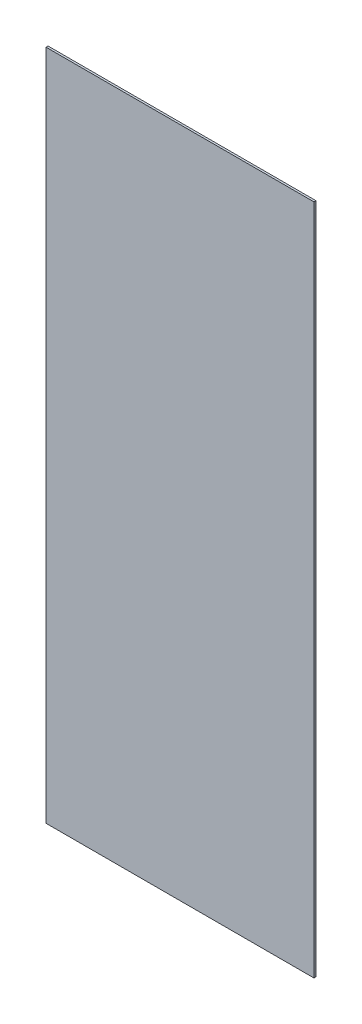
ISO-10303-21;
HEADER;
FILE_DESCRIPTION(('STEP AP214'),'2;1');
FILE_NAME('part.step','',(''),(''),'','','');
FILE_SCHEMA(('AUTOMOTIVE_DESIGN { 1 0 10303 214 1 1 1 1 }'));
ENDSEC;
DATA;
#1=APPLICATION_CONTEXT('core data for automotive mechanical design processes');
#2=APPLICATION_PROTOCOL_DEFINITION('international standard','automotive_design',2000,#1);
#3=PRODUCT_CONTEXT('',#1,'mechanical');
#4=PRODUCT('Part','Part','',(#3));
#5=PRODUCT_RELATED_PRODUCT_CATEGORY('part','',(#4));
#6=PRODUCT_DEFINITION_FORMATION('','',#4);
#7=PRODUCT_DEFINITION_CONTEXT('part definition',#1,'design');
#8=PRODUCT_DEFINITION('design','',#6,#7);
#9=PRODUCT_DEFINITION_SHAPE('','',#8);
#10=(LENGTH_UNIT() NAMED_UNIT(*) SI_UNIT(.MILLI.,.METRE.));
#11=(NAMED_UNIT(*) PLANE_ANGLE_UNIT() SI_UNIT($,.RADIAN.));
#12=(NAMED_UNIT(*) SI_UNIT($,.STERADIAN.) SOLID_ANGLE_UNIT());
#13=UNCERTAINTY_MEASURE_WITH_UNIT(LENGTH_MEASURE(1.E-05),#10,'distance_accuracy_value','');
#14=(GEOMETRIC_REPRESENTATION_CONTEXT(3) GLOBAL_UNCERTAINTY_ASSIGNED_CONTEXT((#13)) GLOBAL_UNIT_ASSIGNED_CONTEXT((#10,
#11,#12)) REPRESENTATION_CONTEXT('',''));
#15=CARTESIAN_POINT('',(0.,0.,0.));
#16=DIRECTION('',(0.,0.,1.));
#17=DIRECTION('',(1.,0.,0.));
#18=AXIS2_PLACEMENT_3D('',#15,#16,#17);
#19=CARTESIAN_POINT('',(395.,18.0000000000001,-6.));
#20=DIRECTION('',(1.,0.,0.));
#21=DIRECTION('',(0.,0.,-1.));
#22=AXIS2_PLACEMENT_3D('',#19,#20,#21);
#23=PLANE('',#22);
#24=DIRECTION('',(0.,1.,0.));
#25=VECTOR('',#24,1.);
#26=CARTESIAN_POINT('',(395.,18.0000000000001,0.));
#27=LINE('',#26,#25);
#28=CARTESIAN_POINT('',(395.,18.0000000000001,0.));
#29=VERTEX_POINT('',#28);
#30=CARTESIAN_POINT('',(395.,2000.,0.));
#31=VERTEX_POINT('',#30);
#32=EDGE_CURVE('E97',#29,#31,#27,.T.);
#33=ORIENTED_EDGE('',*,*,#32,.F.);
#34=DIRECTION('',(0.,0.,1.));
#35=VECTOR('',#34,1.);
#36=CARTESIAN_POINT('',(395.,18.0000000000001,-6.));
#37=LINE('',#36,#35);
#38=CARTESIAN_POINT('',(395.,18.0000000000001,-6.));
#39=VERTEX_POINT('',#38);
#40=EDGE_CURVE('E11',#39,#29,#37,.T.);
#41=ORIENTED_EDGE('',*,*,#40,.F.);
#42=DIRECTION('',(0.,1.,0.));
#43=VECTOR('',#42,1.);
#44=CARTESIAN_POINT('',(395.,18.0000000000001,-6.));
#45=LINE('',#44,#43);
#46=CARTESIAN_POINT('',(395.,2000.,-6.));
#47=VERTEX_POINT('',#46);
#48=EDGE_CURVE('E91',#39,#47,#45,.T.);
#49=ORIENTED_EDGE('',*,*,#48,.T.);
#50=DIRECTION('',(0.,0.,1.));
#51=VECTOR('',#50,1.);
#52=CARTESIAN_POINT('',(395.,2000.,-6.));
#53=LINE('',#52,#51);
#54=EDGE_CURVE('E36',#47,#31,#53,.T.);
#55=ORIENTED_EDGE('',*,*,#54,.T.);
#56=EDGE_LOOP('',(#33,#41,#49,#55));
#57=FACE_BOUND('',#56,.T.);
#58=ADVANCED_FACE('F33',(#57),#23,.T.);
#59=CARTESIAN_POINT('',(395.,18.0000000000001,-6.));
#60=DIRECTION('',(0.,-1.,0.));
#61=DIRECTION('',(0.,0.,-1.));
#62=AXIS2_PLACEMENT_3D('',#59,#60,#61);
#63=PLANE('',#62);
#64=DIRECTION('',(1.,0.,0.));
#65=VECTOR('',#64,1.);
#66=CARTESIAN_POINT('',(395.,18.0000000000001,0.));
#67=LINE('',#66,#65);
#68=CARTESIAN_POINT('',(-395.,18.0000000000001,0.));
#69=VERTEX_POINT('',#68);
#70=EDGE_CURVE('E93',#69,#29,#67,.T.);
#71=ORIENTED_EDGE('',*,*,#70,.F.);
#72=DIRECTION('',(0.,0.,1.));
#73=VECTOR('',#72,1.);
#74=CARTESIAN_POINT('',(-395.,18.0000000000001,-6.));
#75=LINE('',#74,#73);
#76=CARTESIAN_POINT('',(-395.,18.0000000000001,-6.));
#77=VERTEX_POINT('',#76);
#78=EDGE_CURVE('E42',#77,#69,#75,.T.);
#79=ORIENTED_EDGE('',*,*,#78,.F.);
#80=DIRECTION('',(1.,0.,0.));
#81=VECTOR('',#80,1.);
#82=CARTESIAN_POINT('',(395.,18.0000000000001,-6.));
#83=LINE('',#82,#81);
#84=EDGE_CURVE('E88',#77,#39,#83,.T.);
#85=ORIENTED_EDGE('',*,*,#84,.T.);
#86=ORIENTED_EDGE('',*,*,#40,.T.);
#87=EDGE_LOOP('',(#71,#79,#85,#86));
#88=FACE_BOUND('',#87,.T.);
#89=ADVANCED_FACE('F107',(#88),#63,.T.);
#90=CARTESIAN_POINT('',(-395.,18.0000000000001,-6.));
#91=DIRECTION('',(-1.,0.,0.));
#92=DIRECTION('',(0.,0.,1.));
#93=AXIS2_PLACEMENT_3D('',#90,#91,#92);
#94=PLANE('',#93);
#95=DIRECTION('',(0.,-1.,0.));
#96=VECTOR('',#95,1.);
#97=CARTESIAN_POINT('',(-395.,18.0000000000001,0.));
#98=LINE('',#97,#96);
#99=CARTESIAN_POINT('',(-395.,2000.,0.));
#100=VERTEX_POINT('',#99);
#101=EDGE_CURVE('E83',#100,#69,#98,.T.);
#102=ORIENTED_EDGE('',*,*,#101,.F.);
#103=DIRECTION('',(0.,0.,1.));
#104=VECTOR('',#103,1.);
#105=CARTESIAN_POINT('',(-395.,2000.,-6.));
#106=LINE('',#105,#104);
#107=CARTESIAN_POINT('',(-395.,2000.,-6.));
#108=VERTEX_POINT('',#107);
#109=EDGE_CURVE('E78',#108,#100,#106,.T.);
#110=ORIENTED_EDGE('',*,*,#109,.F.);
#111=DIRECTION('',(0.,-1.,0.));
#112=VECTOR('',#111,1.);
#113=CARTESIAN_POINT('',(-395.,18.0000000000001,-6.));
#114=LINE('',#113,#112);
#115=EDGE_CURVE('E81',#108,#77,#114,.T.);
#116=ORIENTED_EDGE('',*,*,#115,.T.);
#117=ORIENTED_EDGE('',*,*,#78,.T.);
#118=EDGE_LOOP('',(#102,#110,#116,#117));
#119=FACE_BOUND('',#118,.T.);
#120=ADVANCED_FACE('F80',(#119),#94,.T.);
#121=CARTESIAN_POINT('',(395.,2000.,-6.));
#122=DIRECTION('',(0.,1.,0.));
#123=DIRECTION('',(0.,0.,1.));
#124=AXIS2_PLACEMENT_3D('',#121,#122,#123);
#125=PLANE('',#124);
#126=DIRECTION('',(-1.,0.,0.));
#127=VECTOR('',#126,1.);
#128=CARTESIAN_POINT('',(395.,2000.,0.));
#129=LINE('',#128,#127);
#130=EDGE_CURVE('E100',#31,#100,#129,.T.);
#131=ORIENTED_EDGE('',*,*,#130,.F.);
#132=ORIENTED_EDGE('',*,*,#54,.F.);
#133=DIRECTION('',(-1.,0.,0.));
#134=VECTOR('',#133,1.);
#135=CARTESIAN_POINT('',(395.,2000.,-6.));
#136=LINE('',#135,#134);
#137=EDGE_CURVE('E87',#47,#108,#136,.T.);
#138=ORIENTED_EDGE('',*,*,#137,.T.);
#139=ORIENTED_EDGE('',*,*,#109,.T.);
#140=EDGE_LOOP('',(#131,#132,#138,#139));
#141=FACE_BOUND('',#140,.T.);
#142=ADVANCED_FACE('F90',(#141),#125,.T.);
#143=CARTESIAN_POINT('',(0.,0.,-6.));
#144=DIRECTION('',(0.,0.,1.));
#145=DIRECTION('',(1.,0.,0.));
#146=AXIS2_PLACEMENT_3D('',#143,#144,#145);
#147=PLANE('',#146);
#148=ORIENTED_EDGE('',*,*,#48,.F.);
#149=ORIENTED_EDGE('',*,*,#84,.F.);
#150=ORIENTED_EDGE('',*,*,#115,.F.);
#151=ORIENTED_EDGE('',*,*,#137,.F.);
#152=EDGE_LOOP('',(#148,#149,#150,#151));
#153=FACE_BOUND('',#152,.T.);
#154=ADVANCED_FACE('F86',(#153),#147,.F.);
#155=CARTESIAN_POINT('',(0.,0.,0.));
#156=DIRECTION('',(0.,0.,1.));
#157=DIRECTION('',(1.,0.,0.));
#158=AXIS2_PLACEMENT_3D('',#155,#156,#157);
#159=PLANE('',#158);
#160=ORIENTED_EDGE('',*,*,#32,.T.);
#161=ORIENTED_EDGE('',*,*,#130,.T.);
#162=ORIENTED_EDGE('',*,*,#101,.T.);
#163=ORIENTED_EDGE('',*,*,#70,.T.);
#164=EDGE_LOOP('',(#160,#161,#162,#163));
#165=FACE_BOUND('',#164,.T.);
#166=ADVANCED_FACE('F106',(#165),#159,.T.);
#167=CLOSED_SHELL('',(#58,#89,#120,#142,#154,#166));
#168=MANIFOLD_SOLID_BREP('B2',#167);
#169=ADVANCED_BREP_SHAPE_REPRESENTATION('',(#18,#168),#14);
#170=SHAPE_DEFINITION_REPRESENTATION(#9,#169);
ENDSEC;
END-ISO-10303-21;
